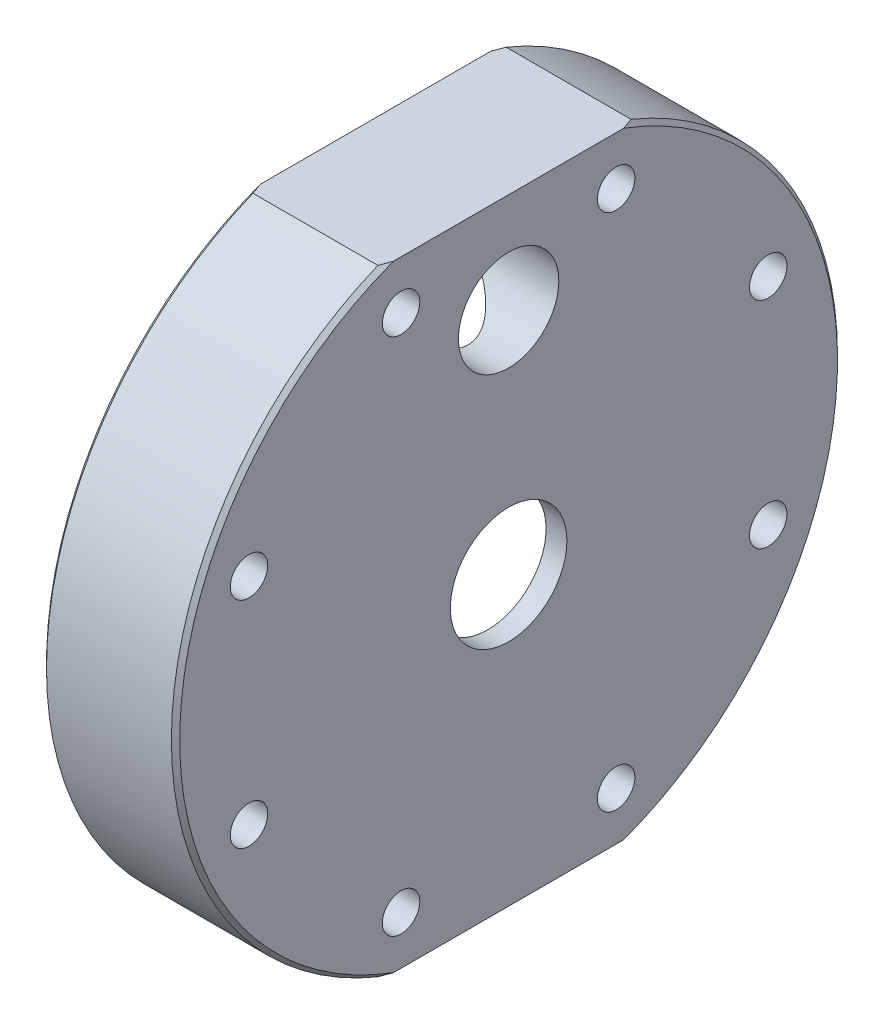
from build123d import *

# Parameters (mm, degrees)
ESQUISSE2_W             = 101.931007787
ESQUISSE2_H             = 26.203343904
ESQUISSE2_W_2           = 151.717361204
ESQUISSE2_H_2           = 31.181979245
ENL_V_MAT_EXTRU_1_DEPTH = 120.491480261
ESQUISSE3_R             = 4.5
ENL_V_MAT_EXTRU_2_DEPTH = 116.41547426
ESQUISSE4_R             = 12.0585
ESQUISSE4_R_2           = 14
ENL_V_MAT_EXTRU_3_DEPTH = 116.41547426
CHANFREIN1_SIZE         = 1


with BuildPart() as part:
    # Esquisse1 → R_volution1 (revolve)
    with BuildSketch(Plane.XY, mode=Mode.PRIVATE) as r_volution1_sk:
        Polygon((29.371051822, 2.790179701), (29.371051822, 36.037458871), (2.371051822, 63.037458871), (2.371051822, 82.790179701), (34.371051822, 82.790179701), (34.371051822, 2.790179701), align=None)
    revolve(r_volution1_sk.sketch.rotate(Axis((13.104530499, 2.790179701, 0), (1, 0, 0)), 90), axis=Axis((13.104530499, 2.790179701, 0), (1, 0, 0)))

    # Esquisse2 → Enl_v. mat.-Extru.1 (cut, through all)
    with BuildSketch(Plane(origin=(34.371051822, 0, 0), x_dir=(0, 0, -1), z_dir=(1, 0, 0))):
        with Locations((0.655083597, 89.891851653)):
            Rectangle(ESQUISSE2_W, ESQUISSE2_H)
        with Locations((4.847618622, -86.800809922)):
            Rectangle(ESQUISSE2_W_2, ESQUISSE2_H_2)
    extrude(amount=-ENL_V_MAT_EXTRU_1_DEPTH, mode=Mode.SUBTRACT)

    # Esquisse3 → Enl_v. mat.-Extru.2 (cut, through all)
    with BuildSketch(Plane(origin=(34.371051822, 0, 0), x_dir=(0, 0, -1), z_dir=(1, 0, 0))):
        with Locations((-25.831131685, 65.152048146)):
            Circle(ESQUISSE3_R)
        with Locations((25.831131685, 65.152048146)):
            Circle(ESQUISSE3_R)
        with Locations((62.361868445, 28.621311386)):
            Circle(ESQUISSE3_R)
        with Locations((62.361868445, -23.040951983)):
            Circle(ESQUISSE3_R)
        with Locations((25.831131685, -59.571688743)):
            Circle(ESQUISSE3_R)
        with Locations((-25.831131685, -59.571688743)):
            Circle(ESQUISSE3_R)
        with Locations((-62.361868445, -23.040951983)):
            Circle(ESQUISSE3_R)
        with Locations((-62.361868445, 28.621311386)):
            Circle(ESQUISSE3_R)
    extrude(amount=-ENL_V_MAT_EXTRU_2_DEPTH, mode=Mode.SUBTRACT)

    # Esquisse4 → Enl_v. mat.-Extru.3 (cut, through all)
    with BuildSketch(Plane(origin=(34.371051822, 0, 0), x_dir=(0, 0, -1), z_dir=(1, 0, 0))):
        with Locations((0, 52.790179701)):
            Circle(ESQUISSE4_R)
        with Locations((0, -2.209820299)):
            Circle(ESQUISSE4_R_2)
    extrude(amount=-ENL_V_MAT_EXTRU_3_DEPTH, mode=Mode.SUBTRACT)

    # Chanfrein1
    chanfrein1_edges = [part.edges().sort_by_distance(p)[0] for p in [
        (2.371051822, 2.790179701, -80),
        (34.371051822, 2.790179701, -80),
        (34.371051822, 2.790179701, 80),
        (2.371051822, 2.790179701, 80),
    ]]
    chamfer(chanfrein1_edges, length=CHANFREIN1_SIZE)


solid = part.part
